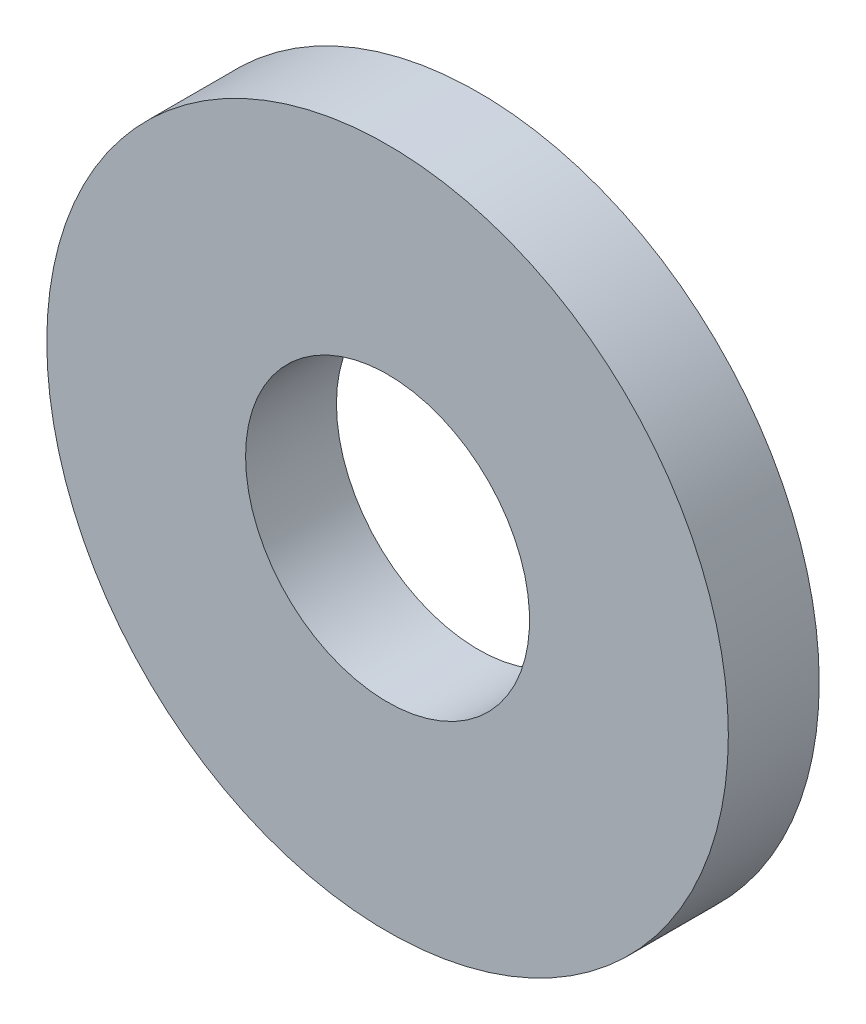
ISO-10303-21;
HEADER;
FILE_DESCRIPTION(('STEP AP214'),'2;1');
FILE_NAME('part.step','',(''),(''),'','','');
FILE_SCHEMA(('AUTOMOTIVE_DESIGN { 1 0 10303 214 1 1 1 1 }'));
ENDSEC;
DATA;
#1=APPLICATION_CONTEXT('core data for automotive mechanical design processes');
#2=APPLICATION_PROTOCOL_DEFINITION('international standard','automotive_design',2000,#1);
#3=PRODUCT_CONTEXT('',#1,'mechanical');
#4=PRODUCT('Part','Part','',(#3));
#5=PRODUCT_RELATED_PRODUCT_CATEGORY('part','',(#4));
#6=PRODUCT_DEFINITION_FORMATION('','',#4);
#7=PRODUCT_DEFINITION_CONTEXT('part definition',#1,'design');
#8=PRODUCT_DEFINITION('design','',#6,#7);
#9=PRODUCT_DEFINITION_SHAPE('','',#8);
#10=(LENGTH_UNIT() NAMED_UNIT(*) SI_UNIT(.MILLI.,.METRE.));
#11=(NAMED_UNIT(*) PLANE_ANGLE_UNIT() SI_UNIT($,.RADIAN.));
#12=(NAMED_UNIT(*) SI_UNIT($,.STERADIAN.) SOLID_ANGLE_UNIT());
#13=UNCERTAINTY_MEASURE_WITH_UNIT(LENGTH_MEASURE(1.E-05),#10,'distance_accuracy_value','');
#14=(GEOMETRIC_REPRESENTATION_CONTEXT(3) GLOBAL_UNCERTAINTY_ASSIGNED_CONTEXT((#13)) GLOBAL_UNIT_ASSIGNED_CONTEXT((#10,
#11,#12)) REPRESENTATION_CONTEXT('',''));
#15=CARTESIAN_POINT('',(0.,0.,0.));
#16=DIRECTION('',(0.,0.,1.));
#17=DIRECTION('',(1.,0.,0.));
#18=AXIS2_PLACEMENT_3D('',#15,#16,#17);
#19=CARTESIAN_POINT('',(0.,0.,0.));
#20=DIRECTION('',(0.,0.,-1.));
#21=DIRECTION('',(-1.,0.,0.));
#22=AXIS2_PLACEMENT_3D('',#19,#20,#21);
#23=CYLINDRICAL_SURFACE('',#22,12.5);
#24=CARTESIAN_POINT('',(0.,0.,0.));
#25=DIRECTION('',(0.,0.,-1.));
#26=DIRECTION('',(-1.,0.,0.));
#27=AXIS2_PLACEMENT_3D('',#24,#25,#26);
#28=CIRCLE('',#27,12.5);
#29=CARTESIAN_POINT('',(-12.5,0.,0.));
#30=VERTEX_POINT('',#29);
#31=EDGE_CURVE('E26',#30,#30,#28,.T.);
#32=ORIENTED_EDGE('',*,*,#31,.T.);
#33=EDGE_LOOP('',(#32));
#34=FACE_BOUND('',#33,.T.);
#35=CARTESIAN_POINT('',(0.,0.,8.));
#36=DIRECTION('',(0.,0.,-1.));
#37=DIRECTION('',(-1.,0.,0.));
#38=AXIS2_PLACEMENT_3D('',#35,#36,#37);
#39=CIRCLE('',#38,12.5);
#40=CARTESIAN_POINT('',(-12.5,0.,8.));
#41=VERTEX_POINT('',#40);
#42=EDGE_CURVE('E8',#41,#41,#39,.T.);
#43=ORIENTED_EDGE('',*,*,#42,.F.);
#44=EDGE_LOOP('',(#43));
#45=FACE_BOUND('',#44,.T.);
#46=ADVANCED_FACE('F12',(#34,#45),#23,.F.);
#47=CARTESIAN_POINT('',(-12.5,0.,8.));
#48=DIRECTION('',(0.,0.,1.));
#49=DIRECTION('',(1.,0.,0.));
#50=AXIS2_PLACEMENT_3D('',#47,#48,#49);
#51=PLANE('',#50);
#52=ORIENTED_EDGE('',*,*,#42,.T.);
#53=EDGE_LOOP('',(#52));
#54=FACE_BOUND('',#53,.T.);
#55=CARTESIAN_POINT('',(0.,0.,8.));
#56=DIRECTION('',(0.,0.,-1.));
#57=DIRECTION('',(-1.,0.,0.));
#58=AXIS2_PLACEMENT_3D('',#55,#56,#57);
#59=CIRCLE('',#58,30.);
#60=CARTESIAN_POINT('',(-30.,0.,8.));
#61=VERTEX_POINT('',#60);
#62=EDGE_CURVE('E18',#61,#61,#59,.T.);
#63=ORIENTED_EDGE('',*,*,#62,.F.);
#64=EDGE_LOOP('',(#63));
#65=FACE_BOUND('',#64,.T.);
#66=ADVANCED_FACE('F43',(#54,#65),#51,.T.);
#67=CARTESIAN_POINT('',(0.,0.,0.));
#68=DIRECTION('',(0.,0.,-1.));
#69=DIRECTION('',(-1.,0.,0.));
#70=AXIS2_PLACEMENT_3D('',#67,#68,#69);
#71=CYLINDRICAL_SURFACE('',#70,30.);
#72=ORIENTED_EDGE('',*,*,#62,.T.);
#73=EDGE_LOOP('',(#72));
#74=FACE_BOUND('',#73,.T.);
#75=CARTESIAN_POINT('',(0.,0.,0.));
#76=DIRECTION('',(0.,0.,-1.));
#77=DIRECTION('',(-1.,0.,0.));
#78=AXIS2_PLACEMENT_3D('',#75,#76,#77);
#79=CIRCLE('',#78,30.);
#80=CARTESIAN_POINT('',(-30.,0.,0.));
#81=VERTEX_POINT('',#80);
#82=EDGE_CURVE('E22',#81,#81,#79,.T.);
#83=ORIENTED_EDGE('',*,*,#82,.F.);
#84=EDGE_LOOP('',(#83));
#85=FACE_BOUND('',#84,.T.);
#86=ADVANCED_FACE('F36',(#74,#85),#71,.T.);
#87=CARTESIAN_POINT('',(-12.5,0.,0.));
#88=DIRECTION('',(0.,0.,-1.));
#89=DIRECTION('',(-1.,0.,0.));
#90=AXIS2_PLACEMENT_3D('',#87,#88,#89);
#91=PLANE('',#90);
#92=ORIENTED_EDGE('',*,*,#82,.T.);
#93=EDGE_LOOP('',(#92));
#94=FACE_BOUND('',#93,.T.);
#95=ORIENTED_EDGE('',*,*,#31,.F.);
#96=EDGE_LOOP('',(#95));
#97=FACE_BOUND('',#96,.T.);
#98=ADVANCED_FACE('F34',(#94,#97),#91,.T.);
#99=CLOSED_SHELL('',(#46,#66,#86,#98));
#100=MANIFOLD_SOLID_BREP('B1',#99);
#101=ADVANCED_BREP_SHAPE_REPRESENTATION('',(#18,#100),#14);
#102=SHAPE_DEFINITION_REPRESENTATION(#9,#101);
ENDSEC;
END-ISO-10303-21;
